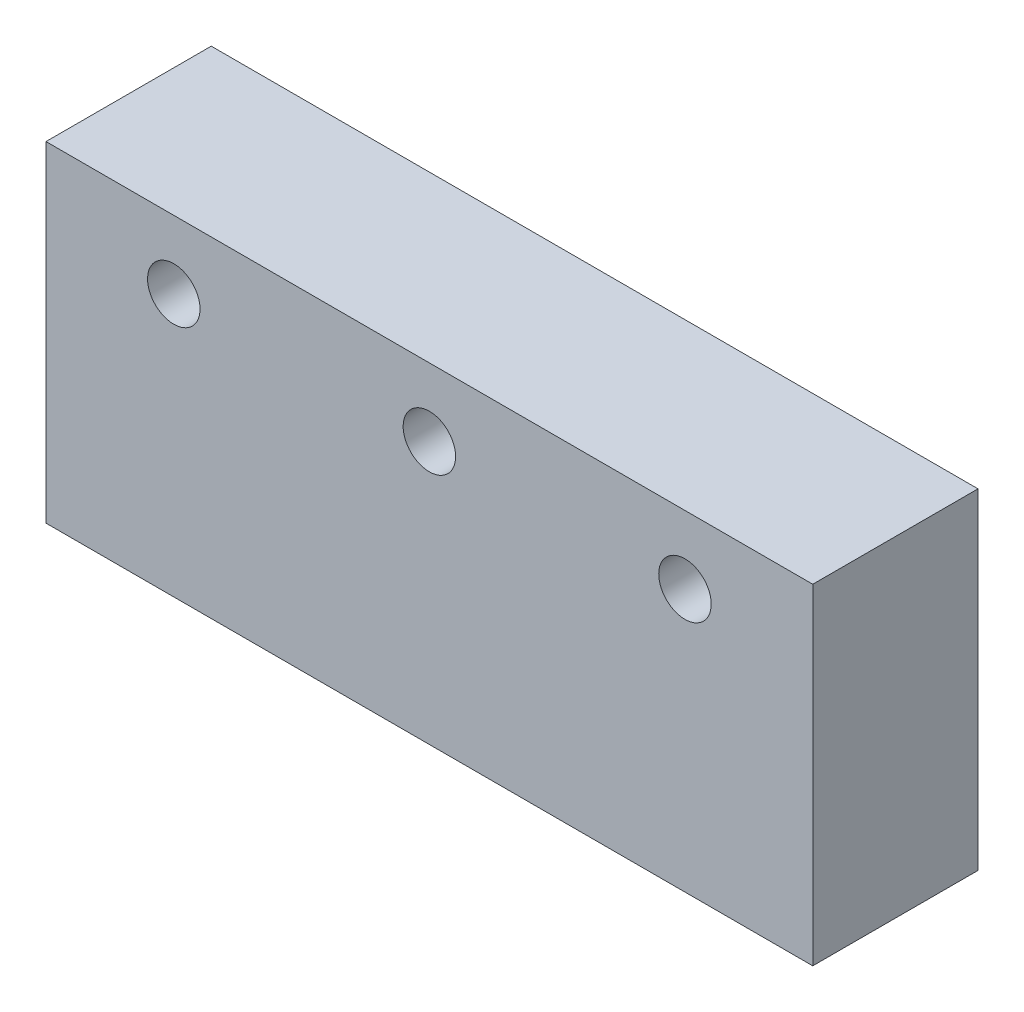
ISO-10303-21;
HEADER;
FILE_DESCRIPTION(('STEP AP214'),'2;1');
FILE_NAME('part.step','',(''),(''),'','','');
FILE_SCHEMA(('AUTOMOTIVE_DESIGN { 1 0 10303 214 1 1 1 1 }'));
ENDSEC;
DATA;
#1=APPLICATION_CONTEXT('core data for automotive mechanical design processes');
#2=APPLICATION_PROTOCOL_DEFINITION('international standard','automotive_design',2000,#1);
#3=PRODUCT_CONTEXT('',#1,'mechanical');
#4=PRODUCT('Part','Part','',(#3));
#5=PRODUCT_RELATED_PRODUCT_CATEGORY('part','',(#4));
#6=PRODUCT_DEFINITION_FORMATION('','',#4);
#7=PRODUCT_DEFINITION_CONTEXT('part definition',#1,'design');
#8=PRODUCT_DEFINITION('design','',#6,#7);
#9=PRODUCT_DEFINITION_SHAPE('','',#8);
#10=(LENGTH_UNIT() NAMED_UNIT(*) SI_UNIT(.MILLI.,.METRE.));
#11=(NAMED_UNIT(*) PLANE_ANGLE_UNIT() SI_UNIT($,.RADIAN.));
#12=(NAMED_UNIT(*) SI_UNIT($,.STERADIAN.) SOLID_ANGLE_UNIT());
#13=UNCERTAINTY_MEASURE_WITH_UNIT(LENGTH_MEASURE(1.E-05),#10,'distance_accuracy_value','');
#14=(GEOMETRIC_REPRESENTATION_CONTEXT(3) GLOBAL_UNCERTAINTY_ASSIGNED_CONTEXT((#13)) GLOBAL_UNIT_ASSIGNED_CONTEXT((#10,
#11,#12)) REPRESENTATION_CONTEXT('',''));
#15=CARTESIAN_POINT('',(0.,0.,0.));
#16=DIRECTION('',(0.,0.,1.));
#17=DIRECTION('',(1.,0.,0.));
#18=AXIS2_PLACEMENT_3D('',#15,#16,#17);
#19=CARTESIAN_POINT('',(0.,-193.603986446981,302.63412279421));
#20=DIRECTION('',(0.,0.,-1.));
#21=DIRECTION('',(-1.,0.,0.));
#22=AXIS2_PLACEMENT_3D('',#19,#20,#21);
#23=CYLINDRICAL_SURFACE('',#22,7.9375);
#24=CARTESIAN_POINT('',(0.,-193.603986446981,0.));
#25=DIRECTION('',(0.,0.,1.));
#26=DIRECTION('',(1.,0.,0.));
#27=AXIS2_PLACEMENT_3D('',#24,#25,#26);
#28=CIRCLE('',#27,7.9375);
#29=CARTESIAN_POINT('',(7.9375,-193.603986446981,0.));
#30=VERTEX_POINT('',#29);
#31=EDGE_CURVE('E87',#30,#30,#28,.T.);
#32=ORIENTED_EDGE('',*,*,#31,.F.);
#33=EDGE_LOOP('',(#32));
#34=FACE_BOUND('',#33,.T.);
#35=CARTESIAN_POINT('',(0.,-193.603986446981,50.));
#36=DIRECTION('',(0.,0.,1.));
#37=DIRECTION('',(0.,-1.,0.));
#38=AXIS2_PLACEMENT_3D('',#35,#36,#37);
#39=CIRCLE('',#38,7.9375);
#40=CARTESIAN_POINT('',(0.,-201.541486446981,50.));
#41=VERTEX_POINT('',#40);
#42=EDGE_CURVE('E80',#41,#41,#39,.T.);
#43=ORIENTED_EDGE('',*,*,#42,.T.);
#44=EDGE_LOOP('',(#43));
#45=FACE_BOUND('',#44,.T.);
#46=ADVANCED_FACE('F16',(#34,#45),#23,.F.);
#47=CARTESIAN_POINT('',(77.3333333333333,-193.603986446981,302.63412279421));
#48=DIRECTION('',(0.,0.,-1.));
#49=DIRECTION('',(-1.,0.,0.));
#50=AXIS2_PLACEMENT_3D('',#47,#48,#49);
#51=CYLINDRICAL_SURFACE('',#50,7.9375);
#52=CARTESIAN_POINT('',(77.3333333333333,-193.603986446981,0.));
#53=DIRECTION('',(0.,0.,1.));
#54=DIRECTION('',(1.,0.,0.));
#55=AXIS2_PLACEMENT_3D('',#52,#53,#54);
#56=CIRCLE('',#55,7.9375);
#57=CARTESIAN_POINT('',(85.2708333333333,-193.603986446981,0.));
#58=VERTEX_POINT('',#57);
#59=EDGE_CURVE('E90',#58,#58,#56,.T.);
#60=ORIENTED_EDGE('',*,*,#59,.F.);
#61=EDGE_LOOP('',(#60));
#62=FACE_BOUND('',#61,.T.);
#63=CARTESIAN_POINT('',(77.3333333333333,-193.603986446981,50.));
#64=DIRECTION('',(0.,0.,1.));
#65=DIRECTION('',(0.,-1.,0.));
#66=AXIS2_PLACEMENT_3D('',#63,#64,#65);
#67=CIRCLE('',#66,7.9375);
#68=CARTESIAN_POINT('',(77.3333333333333,-201.541486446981,50.));
#69=VERTEX_POINT('',#68);
#70=EDGE_CURVE('E76',#69,#69,#67,.T.);
#71=ORIENTED_EDGE('',*,*,#70,.T.);
#72=EDGE_LOOP('',(#71));
#73=FACE_BOUND('',#72,.T.);
#74=ADVANCED_FACE('F133',(#62,#73),#51,.F.);
#75=CARTESIAN_POINT('',(-116.,-173.,302.63412279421));
#76=DIRECTION('',(1.,0.,0.));
#77=DIRECTION('',(0.,1.,0.));
#78=AXIS2_PLACEMENT_3D('',#75,#76,#77);
#79=PLANE('',#78);
#80=DIRECTION('',(0.,-1.,0.));
#81=VECTOR('',#80,1.);
#82=CARTESIAN_POINT('',(-116.,-173.,50.));
#83=LINE('',#82,#81);
#84=CARTESIAN_POINT('',(-116.,-173.,50.));
#85=VERTEX_POINT('',#84);
#86=CARTESIAN_POINT('',(-116.,-273.,50.));
#87=VERTEX_POINT('',#86);
#88=EDGE_CURVE('E61',#85,#87,#83,.T.);
#89=ORIENTED_EDGE('',*,*,#88,.F.);
#90=DIRECTION('',(0.,0.,-1.));
#91=VECTOR('',#90,1.);
#92=CARTESIAN_POINT('',(-116.,-173.,302.63412279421));
#93=LINE('',#92,#91);
#94=CARTESIAN_POINT('',(-116.,-173.,0.));
#95=VERTEX_POINT('',#94);
#96=EDGE_CURVE('E32',#85,#95,#93,.T.);
#97=ORIENTED_EDGE('',*,*,#96,.T.);
#98=DIRECTION('',(0.,-1.,0.));
#99=VECTOR('',#98,1.);
#100=CARTESIAN_POINT('',(-116.,-173.,0.));
#101=LINE('',#100,#99);
#102=CARTESIAN_POINT('',(-116.,-273.,0.));
#103=VERTEX_POINT('',#102);
#104=EDGE_CURVE('E64',#95,#103,#101,.T.);
#105=ORIENTED_EDGE('',*,*,#104,.T.);
#106=DIRECTION('',(0.,0.,-1.));
#107=VECTOR('',#106,1.);
#108=CARTESIAN_POINT('',(-116.,-273.,302.63412279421));
#109=LINE('',#108,#107);
#110=EDGE_CURVE('E57',#87,#103,#109,.T.);
#111=ORIENTED_EDGE('',*,*,#110,.F.);
#112=EDGE_LOOP('',(#89,#97,#105,#111));
#113=FACE_BOUND('',#112,.T.);
#114=ADVANCED_FACE('F59',(#113),#79,.F.);
#115=CARTESIAN_POINT('',(116.,-173.,302.63412279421));
#116=DIRECTION('',(0.,-1.,0.));
#117=DIRECTION('',(0.,0.,-1.));
#118=AXIS2_PLACEMENT_3D('',#115,#116,#117);
#119=PLANE('',#118);
#120=DIRECTION('',(-1.,0.,0.));
#121=VECTOR('',#120,1.);
#122=CARTESIAN_POINT('',(116.,-173.,50.));
#123=LINE('',#122,#121);
#124=CARTESIAN_POINT('',(116.,-173.,50.));
#125=VERTEX_POINT('',#124);
#126=EDGE_CURVE('E75',#125,#85,#123,.T.);
#127=ORIENTED_EDGE('',*,*,#126,.F.);
#128=DIRECTION('',(0.,0.,-1.));
#129=VECTOR('',#128,1.);
#130=CARTESIAN_POINT('',(116.,-173.,302.63412279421));
#131=LINE('',#130,#129);
#132=CARTESIAN_POINT('',(116.,-173.,0.));
#133=VERTEX_POINT('',#132);
#134=EDGE_CURVE('E25',#125,#133,#131,.T.);
#135=ORIENTED_EDGE('',*,*,#134,.T.);
#136=DIRECTION('',(-1.,0.,0.));
#137=VECTOR('',#136,1.);
#138=CARTESIAN_POINT('',(116.,-173.,0.));
#139=LINE('',#138,#137);
#140=EDGE_CURVE('E98',#133,#95,#139,.T.);
#141=ORIENTED_EDGE('',*,*,#140,.T.);
#142=ORIENTED_EDGE('',*,*,#96,.F.);
#143=EDGE_LOOP('',(#127,#135,#141,#142));
#144=FACE_BOUND('',#143,.T.);
#145=ADVANCED_FACE('F102',(#144),#119,.F.);
#146=CARTESIAN_POINT('',(116.,-273.,302.63412279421));
#147=DIRECTION('',(-1.,0.,0.));
#148=DIRECTION('',(0.,-1.,0.));
#149=AXIS2_PLACEMENT_3D('',#146,#147,#148);
#150=PLANE('',#149);
#151=DIRECTION('',(0.,1.,0.));
#152=VECTOR('',#151,1.);
#153=CARTESIAN_POINT('',(116.,-273.,50.));
#154=LINE('',#153,#152);
#155=CARTESIAN_POINT('',(116.,-273.,50.));
#156=VERTEX_POINT('',#155);
#157=EDGE_CURVE('E39',#156,#125,#154,.T.);
#158=ORIENTED_EDGE('',*,*,#157,.F.);
#159=DIRECTION('',(0.,0.,-1.));
#160=VECTOR('',#159,1.);
#161=CARTESIAN_POINT('',(116.,-273.,302.63412279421));
#162=LINE('',#161,#160);
#163=CARTESIAN_POINT('',(116.,-273.,0.));
#164=VERTEX_POINT('',#163);
#165=EDGE_CURVE('E10',#156,#164,#162,.T.);
#166=ORIENTED_EDGE('',*,*,#165,.T.);
#167=DIRECTION('',(0.,1.,0.));
#168=VECTOR('',#167,1.);
#169=CARTESIAN_POINT('',(116.,-273.,0.));
#170=LINE('',#169,#168);
#171=EDGE_CURVE('E95',#164,#133,#170,.T.);
#172=ORIENTED_EDGE('',*,*,#171,.T.);
#173=ORIENTED_EDGE('',*,*,#134,.F.);
#174=EDGE_LOOP('',(#158,#166,#172,#173));
#175=FACE_BOUND('',#174,.T.);
#176=ADVANCED_FACE('F105',(#175),#150,.F.);
#177=CARTESIAN_POINT('',(-116.,-273.,302.63412279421));
#178=DIRECTION('',(0.,1.,0.));
#179=DIRECTION('',(0.,0.,1.));
#180=AXIS2_PLACEMENT_3D('',#177,#178,#179);
#181=PLANE('',#180);
#182=DIRECTION('',(1.,0.,0.));
#183=VECTOR('',#182,1.);
#184=CARTESIAN_POINT('',(-116.,-273.,50.));
#185=LINE('',#184,#183);
#186=EDGE_CURVE('E70',#87,#156,#185,.T.);
#187=ORIENTED_EDGE('',*,*,#186,.F.);
#188=ORIENTED_EDGE('',*,*,#110,.T.);
#189=DIRECTION('',(1.,0.,0.));
#190=VECTOR('',#189,1.);
#191=CARTESIAN_POINT('',(-116.,-273.,0.));
#192=LINE('',#191,#190);
#193=EDGE_CURVE('E93',#103,#164,#192,.T.);
#194=ORIENTED_EDGE('',*,*,#193,.T.);
#195=ORIENTED_EDGE('',*,*,#165,.F.);
#196=EDGE_LOOP('',(#187,#188,#194,#195));
#197=FACE_BOUND('',#196,.T.);
#198=ADVANCED_FACE('F18',(#197),#181,.F.);
#199=CARTESIAN_POINT('',(0.,0.,0.));
#200=DIRECTION('',(0.,0.,1.));
#201=DIRECTION('',(1.,0.,0.));
#202=AXIS2_PLACEMENT_3D('',#199,#200,#201);
#203=PLANE('',#202);
#204=ORIENTED_EDGE('',*,*,#193,.F.);
#205=ORIENTED_EDGE('',*,*,#104,.F.);
#206=ORIENTED_EDGE('',*,*,#140,.F.);
#207=ORIENTED_EDGE('',*,*,#171,.F.);
#208=EDGE_LOOP('',(#204,#205,#206,#207));
#209=FACE_BOUND('',#208,.T.);
#210=ORIENTED_EDGE('',*,*,#59,.T.);
#211=EDGE_LOOP('',(#210));
#212=FACE_BOUND('',#211,.T.);
#213=ORIENTED_EDGE('',*,*,#31,.T.);
#214=EDGE_LOOP('',(#213));
#215=FACE_BOUND('',#214,.T.);
#216=CARTESIAN_POINT('',(-77.3333333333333,-193.603986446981,0.));
#217=DIRECTION('',(0.,0.,1.));
#218=DIRECTION('',(1.,0.,0.));
#219=AXIS2_PLACEMENT_3D('',#216,#217,#218);
#220=CIRCLE('',#219,7.9375);
#221=CARTESIAN_POINT('',(-69.3958333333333,-193.603986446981,0.));
#222=VERTEX_POINT('',#221);
#223=EDGE_CURVE('E72',#222,#222,#220,.T.);
#224=ORIENTED_EDGE('',*,*,#223,.T.);
#225=EDGE_LOOP('',(#224));
#226=FACE_BOUND('',#225,.T.);
#227=ADVANCED_FACE('F107',(#209,#212,#215,#226),#203,.F.);
#228=CARTESIAN_POINT('',(-77.3333333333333,-193.603986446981,302.63412279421));
#229=DIRECTION('',(0.,0.,-1.));
#230=DIRECTION('',(-1.,0.,0.));
#231=AXIS2_PLACEMENT_3D('',#228,#229,#230);
#232=CYLINDRICAL_SURFACE('',#231,7.9375);
#233=ORIENTED_EDGE('',*,*,#223,.F.);
#234=EDGE_LOOP('',(#233));
#235=FACE_BOUND('',#234,.T.);
#236=CARTESIAN_POINT('',(-77.3333333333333,-193.603986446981,50.));
#237=DIRECTION('',(0.,0.,1.));
#238=DIRECTION('',(0.,-1.,0.));
#239=AXIS2_PLACEMENT_3D('',#236,#237,#238);
#240=CIRCLE('',#239,7.9375);
#241=CARTESIAN_POINT('',(-77.3333333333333,-201.541486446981,50.));
#242=VERTEX_POINT('',#241);
#243=EDGE_CURVE('E20',#242,#242,#240,.T.);
#244=ORIENTED_EDGE('',*,*,#243,.T.);
#245=EDGE_LOOP('',(#244));
#246=FACE_BOUND('',#245,.T.);
#247=ADVANCED_FACE('F110',(#235,#246),#232,.F.);
#248=CARTESIAN_POINT('',(-119.,-225.,50.));
#249=DIRECTION('',(0.,0.,1.));
#250=DIRECTION('',(1.,0.,0.));
#251=AXIS2_PLACEMENT_3D('',#248,#249,#250);
#252=PLANE('',#251);
#253=ORIENTED_EDGE('',*,*,#243,.F.);
#254=EDGE_LOOP('',(#253));
#255=FACE_BOUND('',#254,.T.);
#256=ORIENTED_EDGE('',*,*,#42,.F.);
#257=EDGE_LOOP('',(#256));
#258=FACE_BOUND('',#257,.T.);
#259=ORIENTED_EDGE('',*,*,#70,.F.);
#260=EDGE_LOOP('',(#259));
#261=FACE_BOUND('',#260,.T.);
#262=ORIENTED_EDGE('',*,*,#88,.T.);
#263=ORIENTED_EDGE('',*,*,#186,.T.);
#264=ORIENTED_EDGE('',*,*,#157,.T.);
#265=ORIENTED_EDGE('',*,*,#126,.T.);
#266=EDGE_LOOP('',(#262,#263,#264,#265));
#267=FACE_BOUND('',#266,.T.);
#268=ADVANCED_FACE('F74',(#255,#258,#261,#267),#252,.T.);
#269=CLOSED_SHELL('',(#46,#74,#114,#145,#176,#198,#227,#247,#268));
#270=MANIFOLD_SOLID_BREP('B1',#269);
#271=ADVANCED_BREP_SHAPE_REPRESENTATION('',(#18,#270),#14);
#272=SHAPE_DEFINITION_REPRESENTATION(#9,#271);
ENDSEC;
END-ISO-10303-21;
